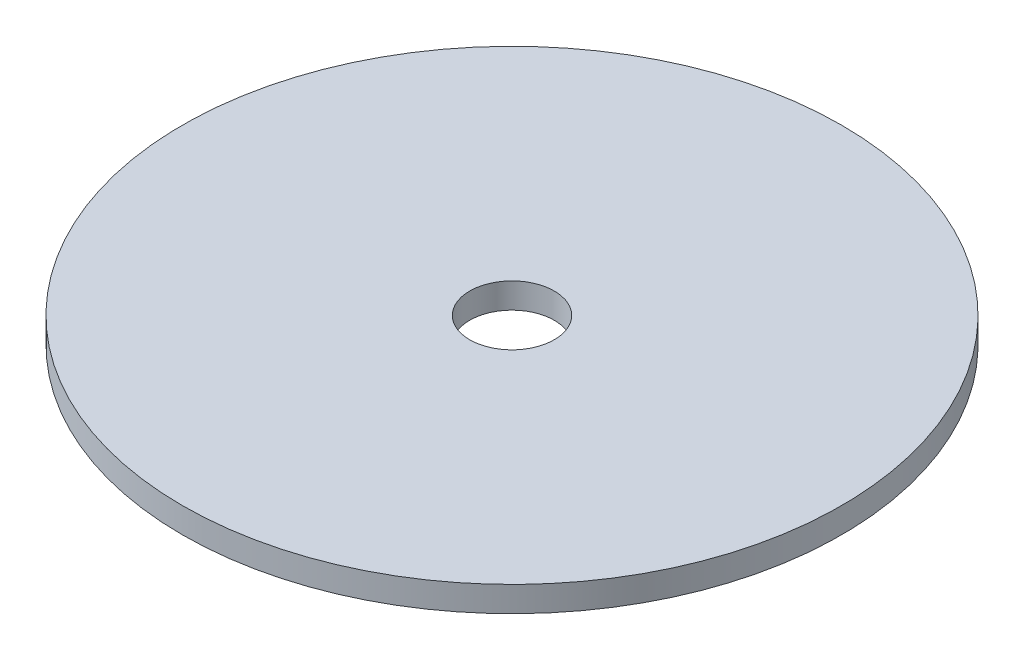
ISO-10303-21;
HEADER;
FILE_DESCRIPTION(('STEP AP214'),'2;1');
FILE_NAME('part.step','',(''),(''),'','','');
FILE_SCHEMA(('AUTOMOTIVE_DESIGN { 1 0 10303 214 1 1 1 1 }'));
ENDSEC;
DATA;
#1=APPLICATION_CONTEXT('core data for automotive mechanical design processes');
#2=APPLICATION_PROTOCOL_DEFINITION('international standard','automotive_design',2000,#1);
#3=PRODUCT_CONTEXT('',#1,'mechanical');
#4=PRODUCT('Part','Part','',(#3));
#5=PRODUCT_RELATED_PRODUCT_CATEGORY('part','',(#4));
#6=PRODUCT_DEFINITION_FORMATION('','',#4);
#7=PRODUCT_DEFINITION_CONTEXT('part definition',#1,'design');
#8=PRODUCT_DEFINITION('design','',#6,#7);
#9=PRODUCT_DEFINITION_SHAPE('','',#8);
#10=(LENGTH_UNIT() NAMED_UNIT(*) SI_UNIT(.MILLI.,.METRE.));
#11=(NAMED_UNIT(*) PLANE_ANGLE_UNIT() SI_UNIT($,.RADIAN.));
#12=(NAMED_UNIT(*) SI_UNIT($,.STERADIAN.) SOLID_ANGLE_UNIT());
#13=UNCERTAINTY_MEASURE_WITH_UNIT(LENGTH_MEASURE(1.E-05),#10,'distance_accuracy_value','');
#14=(GEOMETRIC_REPRESENTATION_CONTEXT(3) GLOBAL_UNCERTAINTY_ASSIGNED_CONTEXT((#13)) GLOBAL_UNIT_ASSIGNED_CONTEXT((#10,
#11,#12)) REPRESENTATION_CONTEXT('',''));
#15=CARTESIAN_POINT('',(0.,0.,0.));
#16=DIRECTION('',(0.,0.,1.));
#17=DIRECTION('',(1.,0.,0.));
#18=AXIS2_PLACEMENT_3D('',#15,#16,#17);
#19=CARTESIAN_POINT('',(0.,1.5,0.));
#20=DIRECTION('',(0.,1.,0.));
#21=DIRECTION('',(0.,0.,1.));
#22=AXIS2_PLACEMENT_3D('',#19,#20,#21);
#23=PLANE('',#22);
#24=CARTESIAN_POINT('',(0.,1.5,0.));
#25=DIRECTION('',(0.,1.,0.));
#26=DIRECTION('',(0.,0.,1.));
#27=AXIS2_PLACEMENT_3D('',#24,#25,#26);
#28=CIRCLE('',#27,39.);
#29=CARTESIAN_POINT('',(0.,1.5,39.));
#30=VERTEX_POINT('',#29);
#31=EDGE_CURVE('E10',#30,#30,#28,.T.);
#32=ORIENTED_EDGE('',*,*,#31,.T.);
#33=EDGE_LOOP('',(#32));
#34=FACE_BOUND('',#33,.T.);
#35=CARTESIAN_POINT('',(0.,1.5,0.));
#36=DIRECTION('',(0.,1.,0.));
#37=DIRECTION('',(0.,0.,1.));
#38=AXIS2_PLACEMENT_3D('',#35,#36,#37);
#39=CIRCLE('',#38,5.);
#40=CARTESIAN_POINT('',(0.,1.5,5.));
#41=VERTEX_POINT('',#40);
#42=EDGE_CURVE('E48',#41,#41,#39,.T.);
#43=ORIENTED_EDGE('',*,*,#42,.F.);
#44=EDGE_LOOP('',(#43));
#45=FACE_BOUND('',#44,.T.);
#46=ADVANCED_FACE('F37',(#34,#45),#23,.T.);
#47=CARTESIAN_POINT('',(0.,-1.5,0.));
#48=DIRECTION('',(0.,1.,0.));
#49=DIRECTION('',(0.,0.,1.));
#50=AXIS2_PLACEMENT_3D('',#47,#48,#49);
#51=PLANE('',#50);
#52=CARTESIAN_POINT('',(0.,-1.5,0.));
#53=DIRECTION('',(0.,1.,0.));
#54=DIRECTION('',(0.,0.,1.));
#55=AXIS2_PLACEMENT_3D('',#52,#53,#54);
#56=CIRCLE('',#55,39.);
#57=CARTESIAN_POINT('',(0.,-1.5,39.));
#58=VERTEX_POINT('',#57);
#59=EDGE_CURVE('E41',#58,#58,#56,.T.);
#60=ORIENTED_EDGE('',*,*,#59,.F.);
#61=EDGE_LOOP('',(#60));
#62=FACE_BOUND('',#61,.T.);
#63=CARTESIAN_POINT('',(0.,-1.5,0.));
#64=DIRECTION('',(0.,1.,0.));
#65=DIRECTION('',(0.,0.,1.));
#66=AXIS2_PLACEMENT_3D('',#63,#64,#65);
#67=CIRCLE('',#66,5.);
#68=CARTESIAN_POINT('',(0.,-1.5,5.));
#69=VERTEX_POINT('',#68);
#70=EDGE_CURVE('E50',#69,#69,#67,.T.);
#71=ORIENTED_EDGE('',*,*,#70,.T.);
#72=EDGE_LOOP('',(#71));
#73=FACE_BOUND('',#72,.T.);
#74=ADVANCED_FACE('F60',(#62,#73),#51,.F.);
#75=CARTESIAN_POINT('',(0.,1.5,0.));
#76=DIRECTION('',(0.,-1.,0.));
#77=DIRECTION('',(0.,0.,-1.));
#78=AXIS2_PLACEMENT_3D('',#75,#76,#77);
#79=CYLINDRICAL_SURFACE('',#78,39.);
#80=ORIENTED_EDGE('',*,*,#31,.F.);
#81=EDGE_LOOP('',(#80));
#82=FACE_BOUND('',#81,.T.);
#83=ORIENTED_EDGE('',*,*,#59,.T.);
#84=EDGE_LOOP('',(#83));
#85=FACE_BOUND('',#84,.T.);
#86=ADVANCED_FACE('F39',(#82,#85),#79,.T.);
#87=CARTESIAN_POINT('',(0.,1.5,0.));
#88=DIRECTION('',(0.,-1.,0.));
#89=DIRECTION('',(0.,0.,-1.));
#90=AXIS2_PLACEMENT_3D('',#87,#88,#89);
#91=CYLINDRICAL_SURFACE('',#90,5.);
#92=ORIENTED_EDGE('',*,*,#42,.T.);
#93=EDGE_LOOP('',(#92));
#94=FACE_BOUND('',#93,.T.);
#95=ORIENTED_EDGE('',*,*,#70,.F.);
#96=EDGE_LOOP('',(#95));
#97=FACE_BOUND('',#96,.T.);
#98=ADVANCED_FACE('F56',(#94,#97),#91,.F.);
#99=CLOSED_SHELL('',(#46,#74,#86,#98));
#100=MANIFOLD_SOLID_BREP('B2',#99);
#101=ADVANCED_BREP_SHAPE_REPRESENTATION('',(#18,#100),#14);
#102=SHAPE_DEFINITION_REPRESENTATION(#9,#101);
ENDSEC;
END-ISO-10303-21;
